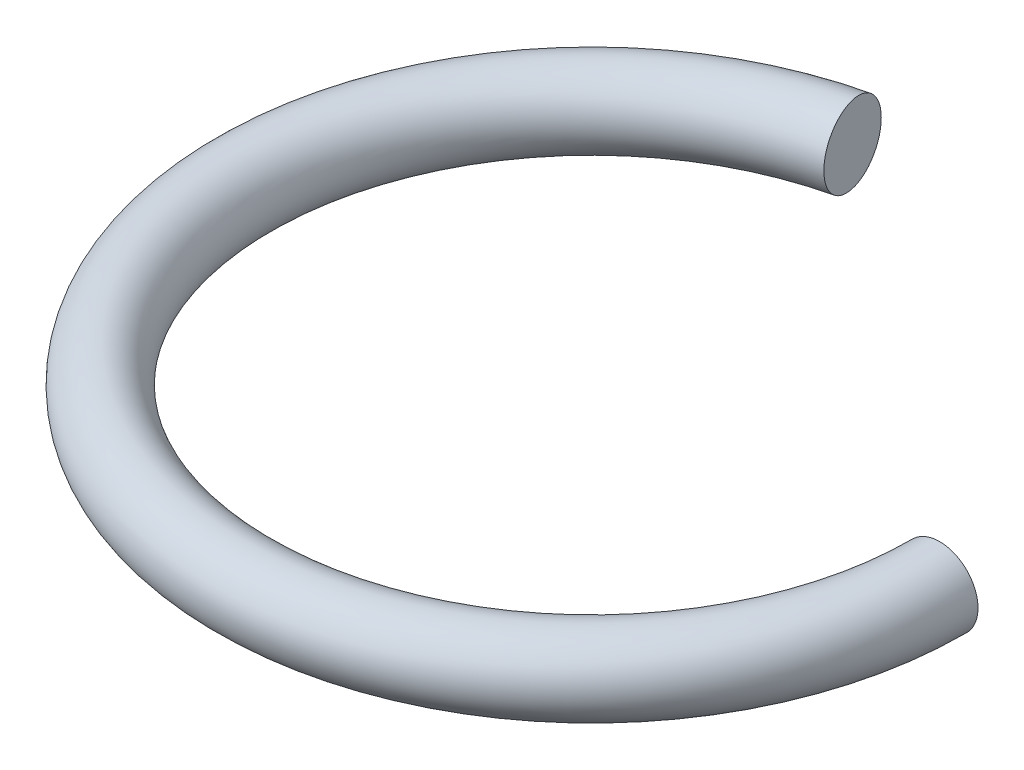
from build123d import *

# Parameters (mm, degrees)
ESQUISSE2_R       = 1.235
R_VOLUTION1_ANGLE = 257


with BuildPart() as part:
    # Esquisse2 → R_volution1 (revolve)
    with BuildSketch(Plane.XY):
        with Locations((11.419579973, -13.217266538)):
            Circle(ESQUISSE2_R)
    revolve(axis=Axis((0.203748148, -8.992442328, 0), (0, -1, 0)), revolution_arc=R_VOLUTION1_ANGLE)


solid = part.part
